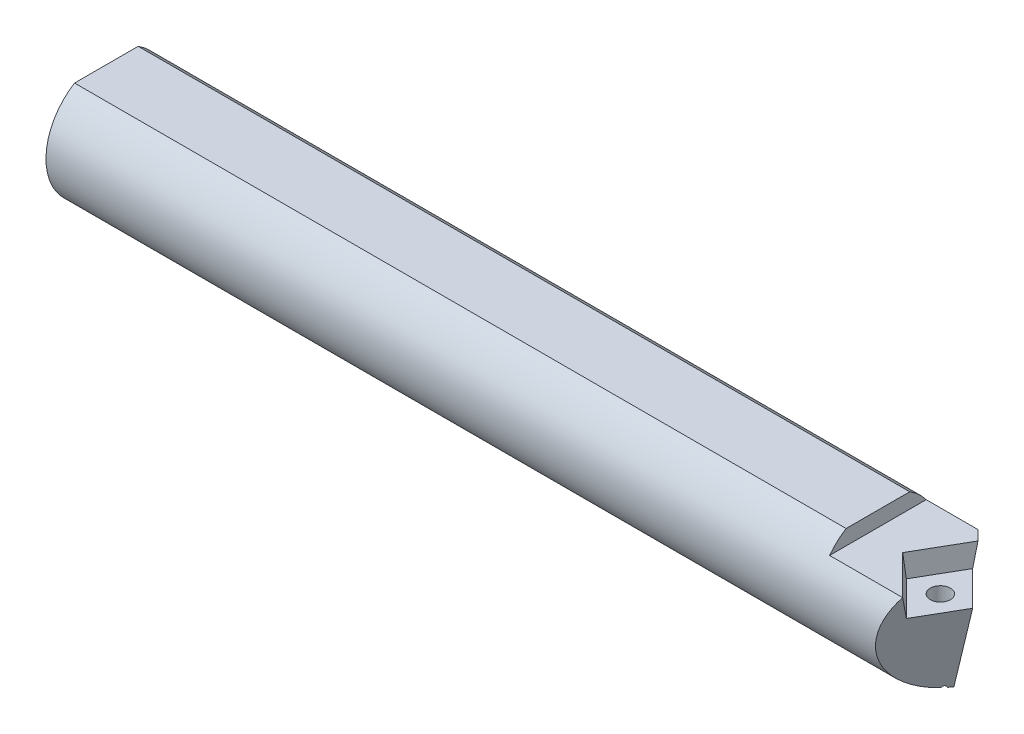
ISO-10303-21;
HEADER;
FILE_DESCRIPTION(('STEP AP214'),'2;1');
FILE_NAME('part.step','',(''),(''),'','','');
FILE_SCHEMA(('AUTOMOTIVE_DESIGN { 1 0 10303 214 1 1 1 1 }'));
ENDSEC;
DATA;
#1=APPLICATION_CONTEXT('core data for automotive mechanical design processes');
#2=APPLICATION_PROTOCOL_DEFINITION('international standard','automotive_design',2000,#1);
#3=PRODUCT_CONTEXT('',#1,'mechanical');
#4=PRODUCT('Part','Part','',(#3));
#5=PRODUCT_RELATED_PRODUCT_CATEGORY('part','',(#4));
#6=PRODUCT_DEFINITION_FORMATION('','',#4);
#7=PRODUCT_DEFINITION_CONTEXT('part definition',#1,'design');
#8=PRODUCT_DEFINITION('design','',#6,#7);
#9=PRODUCT_DEFINITION_SHAPE('','',#8);
#10=(LENGTH_UNIT() NAMED_UNIT(*) SI_UNIT(.MILLI.,.METRE.));
#11=(NAMED_UNIT(*) PLANE_ANGLE_UNIT() SI_UNIT($,.RADIAN.));
#12=(NAMED_UNIT(*) SI_UNIT($,.STERADIAN.) SOLID_ANGLE_UNIT());
#13=UNCERTAINTY_MEASURE_WITH_UNIT(LENGTH_MEASURE(1.E-05),#10,'distance_accuracy_value','');
#14=(GEOMETRIC_REPRESENTATION_CONTEXT(3) GLOBAL_UNCERTAINTY_ASSIGNED_CONTEXT((#13)) GLOBAL_UNIT_ASSIGNED_CONTEXT((#10,
#11,#12)) REPRESENTATION_CONTEXT('',''));
#15=CARTESIAN_POINT('',(0.,0.,0.));
#16=DIRECTION('',(0.,0.,1.));
#17=DIRECTION('',(1.,0.,0.));
#18=AXIS2_PLACEMENT_3D('',#15,#16,#17);
#19=CARTESIAN_POINT('',(50.,5.4,10.3667208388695));
#20=DIRECTION('',(0.,-1.,0.));
#21=DIRECTION('',(0.,0.,-1.));
#22=AXIS2_PLACEMENT_3D('',#19,#20,#21);
#23=PLANE('',#22);
#24=DIRECTION('',(-0.707106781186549,0.,-0.707106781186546));
#25=VECTOR('',#24,1.);
#26=CARTESIAN_POINT('',(32.4594046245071,5.4,-32.4594046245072));
#27=LINE('',#26,#25);
#28=CARTESIAN_POINT('',(59.1875165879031,5.4,-5.73129266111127));
#29=VERTEX_POINT('',#28);
#30=CARTESIAN_POINT('',(57.7188092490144,5.4,-7.2));
#31=VERTEX_POINT('',#30);
#32=EDGE_CURVE('E254',#29,#31,#27,.T.);
#33=ORIENTED_EDGE('',*,*,#32,.T.);
#34=DIRECTION('',(-1.,0.,0.));
#35=VECTOR('',#34,1.);
#36=CARTESIAN_POINT('',(65.,5.4,-7.2));
#37=LINE('',#36,#35);
#38=CARTESIAN_POINT('',(50.,5.4,-7.2));
#39=VERTEX_POINT('',#38);
#40=EDGE_CURVE('E154',#39,#31,#37,.F.);
#41=ORIENTED_EDGE('',*,*,#40,.F.);
#42=DIRECTION('',(0.,0.,-1.));
#43=VECTOR('',#42,1.);
#44=CARTESIAN_POINT('',(50.,5.4,10.3667208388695));
#45=LINE('',#44,#43);
#46=CARTESIAN_POINT('',(50.,5.4,7.2));
#47=VERTEX_POINT('',#46);
#48=EDGE_CURVE('E151',#47,#39,#45,.T.);
#49=ORIENTED_EDGE('',*,*,#48,.F.);
#50=DIRECTION('',(-1.,0.,0.));
#51=VECTOR('',#50,1.);
#52=CARTESIAN_POINT('',(65.,5.4,7.2));
#53=LINE('',#52,#51);
#54=CARTESIAN_POINT('',(60.889953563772,5.4,7.2));
#55=VERTEX_POINT('',#54);
#56=EDGE_CURVE('E130',#55,#47,#53,.T.);
#57=ORIENTED_EDGE('',*,*,#56,.F.);
#58=DIRECTION('',(0.707106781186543,0.,0.707106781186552));
#59=VECTOR('',#58,1.);
#60=CARTESIAN_POINT('',(60.889953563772,5.4,7.2));
#61=LINE('',#60,#59);
#62=CARTESIAN_POINT('',(55.0774701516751,5.4,1.38751658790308));
#63=VERTEX_POINT('',#62);
#64=EDGE_CURVE('E138',#63,#55,#61,.T.);
#65=ORIENTED_EDGE('',*,*,#64,.F.);
#66=DIRECTION('',(-0.500000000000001,0.,0.866025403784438));
#67=VECTOR('',#66,1.);
#68=CARTESIAN_POINT('',(55.0774701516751,5.4,1.38751658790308));
#69=LINE('',#68,#67);
#70=EDGE_CURVE('E147',#29,#63,#69,.T.);
#71=ORIENTED_EDGE('',*,*,#70,.F.);
#72=EDGE_LOOP('',(#33,#41,#49,#57,#65,#71));
#73=FACE_BOUND('',#72,.T.);
#74=ADVANCED_FACE('F39',(#73),#23,.F.);
#75=CARTESIAN_POINT('',(65.,0.,0.));
#76=DIRECTION('',(-1.,0.,0.));
#77=DIRECTION('',(0.,0.,1.));
#78=AXIS2_PLACEMENT_3D('',#75,#76,#77);
#79=CYLINDRICAL_SURFACE('',#78,9.);
#80=CARTESIAN_POINT('',(63.5722436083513,0.,0.));
#81=DIRECTION('',(-0.696364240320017,0.173648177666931,0.696364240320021));
#82=DIRECTION('',(-0.717688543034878,-0.168488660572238,-0.675673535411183));
#83=AXIS2_PLACEMENT_3D('',#80,#81,#82);
#84=ELLIPSE('',#83,12.9242707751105,9.);
#85=CARTESIAN_POINT('',(60.7424942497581,-8.98062018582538,-0.590305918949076));
#86=VERTEX_POINT('',#85);
#87=EDGE_CURVE('E258',#86,#31,#84,.F.);
#88=ORIENTED_EDGE('',*,*,#87,.F.);
#89=CARTESIAN_POINT('',(58.7307883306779,-9.,0.));
#90=CARTESIAN_POINT('',(58.6899566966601,-8.99999886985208,0.0727311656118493));
#91=CARTESIAN_POINT('',(58.6551839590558,-8.99911060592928,0.148914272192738));
#92=CARTESIAN_POINT('',(58.5987760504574,-8.99514012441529,0.305993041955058));
#93=CARTESIAN_POINT('',(58.5771514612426,-8.99205614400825,0.386892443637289));
#94=CARTESIAN_POINT('',(58.5476513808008,-8.98349231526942,0.551008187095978));
#95=CARTESIAN_POINT('',(58.539770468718,-8.97801341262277,0.634223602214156));
#96=CARTESIAN_POINT('',(58.5378909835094,-8.96470842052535,0.800605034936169));
#97=CARTESIAN_POINT('',(58.5438904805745,-8.95688265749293,0.883771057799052));
#98=CARTESIAN_POINT('',(58.5695317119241,-8.93915866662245,1.04799109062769));
#99=CARTESIAN_POINT('',(58.5892131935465,-8.92925445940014,1.12903823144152));
#100=CARTESIAN_POINT('',(58.6416196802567,-8.90791874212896,1.28658843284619));
#101=CARTESIAN_POINT('',(58.6743463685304,-8.89648703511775,1.36309090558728));
#102=CARTESIAN_POINT('',(58.7525726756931,-8.87260610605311,1.51081423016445));
#103=CARTESIAN_POINT('',(58.7982822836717,-8.86014276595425,1.58192162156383));
#104=CARTESIAN_POINT('',(58.9009792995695,-8.83525608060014,1.71548033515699));
#105=CARTESIAN_POINT('',(58.9579678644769,-8.82283273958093,1.77793076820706));
#106=CARTESIAN_POINT('',(59.0824394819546,-8.79883823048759,1.89313349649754));
#107=CARTESIAN_POINT('',(59.1500350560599,-8.78727842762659,1.94576676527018));
#108=CARTESIAN_POINT('',(59.2934143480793,-8.76614148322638,2.03888496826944));
#109=CARTESIAN_POINT('',(59.369197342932,-8.75656416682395,2.07937097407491));
#110=CARTESIAN_POINT('',(59.5257097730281,-8.74036800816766,2.14642652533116));
#111=CARTESIAN_POINT('',(59.606354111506,-8.73370924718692,2.17318475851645));
#112=CARTESIAN_POINT('',(59.7711950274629,-8.72377437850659,2.21273196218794));
#113=CARTESIAN_POINT('',(59.8553908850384,-8.72049758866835,2.22552374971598));
#114=CARTESIAN_POINT('',(60.0224324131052,-8.71768009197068,2.23653398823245));
#115=CARTESIAN_POINT('',(60.1052505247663,-8.71803802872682,2.23514779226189));
#116=CARTESIAN_POINT('',(60.2694416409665,-8.72221286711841,2.21879975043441));
#117=CARTESIAN_POINT('',(60.3508147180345,-8.72602959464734,2.20383858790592));
#118=CARTESIAN_POINT('',(60.509183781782,-8.73673288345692,2.16101269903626));
#119=CARTESIAN_POINT('',(60.5862089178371,-8.74359530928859,2.13324935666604));
#120=CARTESIAN_POINT('',(60.7345183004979,-8.75979537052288,2.06571655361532));
#121=CARTESIAN_POINT('',(60.8058018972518,-8.76913328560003,2.02594573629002));
#122=CARTESIAN_POINT('',(60.9422860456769,-8.7897512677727,1.93455599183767));
#123=CARTESIAN_POINT('',(61.007321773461,-8.80106895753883,1.88269951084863));
#124=CARTESIAN_POINT('',(61.1278741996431,-8.82461039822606,1.76907091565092));
#125=CARTESIAN_POINT('',(61.1833894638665,-8.83683428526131,1.70729731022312));
#126=CARTESIAN_POINT('',(61.2847373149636,-8.86159471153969,1.57380211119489));
#127=CARTESIAN_POINT('',(61.3302943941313,-8.87413145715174,1.50187111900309));
#128=CARTESIAN_POINT('',(61.4086535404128,-8.89831448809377,1.35122634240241));
#129=CARTESIAN_POINT('',(61.4414553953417,-8.90996075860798,1.27251244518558));
#130=CARTESIAN_POINT('',(61.4933466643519,-8.93162079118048,1.11033622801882));
#131=CARTESIAN_POINT('',(61.5124159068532,-8.94163213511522,1.02686711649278));
#132=CARTESIAN_POINT('',(61.5360950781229,-8.95944355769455,0.857672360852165));
#133=CARTESIAN_POINT('',(61.540706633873,-8.96724388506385,0.771946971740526));
#134=CARTESIAN_POINT('',(61.5352753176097,-8.98022225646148,0.60226598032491));
#135=CARTESIAN_POINT('',(61.5254861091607,-8.98544357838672,0.518305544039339));
#136=CARTESIAN_POINT('',(61.4919232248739,-8.99345057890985,0.353109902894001));
#137=CARTESIAN_POINT('',(61.4681504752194,-8.99623641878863,0.271874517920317));
#138=CARTESIAN_POINT('',(61.4076369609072,-8.99959621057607,0.115434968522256));
#139=CARTESIAN_POINT('',(61.3710506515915,-9.00019557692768,0.0401715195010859));
#140=CARTESIAN_POINT('',(61.285893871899,-8.99969396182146,-0.103231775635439));
#141=CARTESIAN_POINT('',(61.2373231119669,-8.99859293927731,-0.171371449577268));
#142=CARTESIAN_POINT('',(61.129349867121,-8.99526340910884,-0.298877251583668));
#143=CARTESIAN_POINT('',(61.0699054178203,-8.99303047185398,-0.358207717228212));
#144=CARTESIAN_POINT('',(60.9419748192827,-8.98808369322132,-0.466130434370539));
#145=CARTESIAN_POINT('',(60.8734882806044,-8.98536983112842,-0.514722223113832));
#146=CARTESIAN_POINT('',(60.728838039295,-8.98007171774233,-0.60013658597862));
#147=CARTESIAN_POINT('',(60.652621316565,-8.97748857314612,-0.636869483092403));
#148=CARTESIAN_POINT('',(60.4950860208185,-8.97301889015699,-0.697027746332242));
#149=CARTESIAN_POINT('',(60.4137674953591,-8.97113234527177,-0.720453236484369));
#150=CARTESIAN_POINT('',(60.2483626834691,-8.96843292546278,-0.753316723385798));
#151=CARTESIAN_POINT('',(60.1642773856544,-8.96761967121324,-0.762759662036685));
#152=CARTESIAN_POINT('',(59.9957150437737,-8.96722401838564,-0.767397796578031));
#153=CARTESIAN_POINT('',(59.9112380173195,-8.9676415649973,-0.76259362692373));
#154=CARTESIAN_POINT('',(59.7445628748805,-8.96962315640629,-0.738917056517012));
#155=CARTESIAN_POINT('',(59.6623585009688,-8.97118363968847,-0.720088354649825));
#156=CARTESIAN_POINT('',(59.5022592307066,-8.97514125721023,-0.66894825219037));
#157=CARTESIAN_POINT('',(59.4243652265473,-8.9775385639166,-0.636634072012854));
#158=CARTESIAN_POINT('',(59.2749021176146,-8.98268505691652,-0.559345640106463));
#159=CARTESIAN_POINT('',(59.2033495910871,-8.98543512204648,-0.514339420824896));
#160=CARTESIAN_POINT('',(59.0688430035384,-8.99066199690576,-0.412985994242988));
#161=CARTESIAN_POINT('',(59.0058814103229,-8.99313904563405,-0.356648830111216));
#162=CARTESIAN_POINT('',(58.9060246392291,-8.99661243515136,-0.250902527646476));
#163=CARTESIAN_POINT('',(58.8666954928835,-8.9978282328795,-0.203771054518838));
#164=CARTESIAN_POINT('',(58.7940826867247,-8.99952242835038,-0.105047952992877));
#165=CARTESIAN_POINT('',(58.7607989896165,-9.00000083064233,-0.0534563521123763));
#166=CARTESIAN_POINT('',(58.7307883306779,-9.,0.));
#167=B_SPLINE_CURVE_WITH_KNOTS('',3,(#89,#90,#91,#92,#93,#94,#95,#96,#97,#98,#99,#100,#101,#102,
#103,#104,#105,#106,#107,#108,#109,#110,#111,#112,#113,#114,#115,#116,#117,#118,#119,#120,#121,
#122,#123,#124,#125,#126,#127,#128,#129,#130,#131,#132,#133,#134,#135,#136,#137,#138,#139,#140,
#141,#142,#143,#144,#145,#146,#147,#148,#149,#150,#151,#152,#153,#154,#155,#156,#157,#158,#159,
#160,#161,#162,#163,#164,#165,#166),.UNSPECIFIED.,.T.,.F.,(4,2,2,2,2,2,2,2,2,2,2,2,2,2,2,2,2,2,
2,2,2,2,2,2,2,2,2,2,2,2,2,2,2,2,2,2,2,2,4),(0.,0.250005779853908,0.500212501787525,
0.750320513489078,1.00039375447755,1.25119653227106,1.50203168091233,1.75718068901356,
2.01235588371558,2.27044814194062,2.52851762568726,2.7829379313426,3.03730691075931,
3.28460259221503,3.53188582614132,3.7772435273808,4.02262896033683,4.27331932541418,
4.52404742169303,4.78101842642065,5.03799370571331,5.29534568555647,5.55266870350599,
5.80551300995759,6.05834057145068,6.30821985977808,6.55810518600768,6.80897605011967,
7.05985772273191,7.3125943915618,7.56532870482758,7.81797367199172,8.07060738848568,
8.32245720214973,8.57435895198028,8.82690092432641,9.07922003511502,9.26297179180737,
9.44672241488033),.UNSPECIFIED.);
#168=CARTESIAN_POINT('',(61.1354474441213,-8.82669347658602,1.75769231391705));
#169=VERTEX_POINT('',#168);
#170=EDGE_CURVE('E133',#86,#169,#167,.T.);
#171=ORIENTED_EDGE('',*,*,#170,.T.);
#172=CARTESIAN_POINT('',(63.9474092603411,0.,0.));
#173=DIRECTION('',(-0.852868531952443,0.173648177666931,-0.492403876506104));
#174=DIRECTION('',(-0.522125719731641,-0.283646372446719,0.804319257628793));
#175=AXIS2_PLACEMENT_3D('',#172,#173,#174);
#176=ELLIPSE('',#175,10.5526228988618,9.);
#177=EDGE_CURVE('E56',#55,#169,#176,.F.);
#178=ORIENTED_EDGE('',*,*,#177,.F.);
#179=ORIENTED_EDGE('',*,*,#56,.T.);
#180=CARTESIAN_POINT('',(50.,0.,0.));
#181=DIRECTION('',(-1.,0.,0.));
#182=DIRECTION('',(0.,0.,1.));
#183=AXIS2_PLACEMENT_3D('',#180,#181,#182);
#184=CIRCLE('',#183,9.);
#185=CARTESIAN_POINT('',(50.,7.65,4.74104418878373));
#186=VERTEX_POINT('',#185);
#187=EDGE_CURVE('E162',#47,#186,#184,.T.);
#188=ORIENTED_EDGE('',*,*,#187,.T.);
#189=DIRECTION('',(-1.,0.,0.));
#190=VECTOR('',#189,1.);
#191=CARTESIAN_POINT('',(65.,7.65,4.74104418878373));
#192=LINE('',#191,#190);
#193=CARTESIAN_POINT('',(-65.,7.65,4.74104418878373));
#194=VERTEX_POINT('',#193);
#195=EDGE_CURVE('E153',#194,#186,#192,.F.);
#196=ORIENTED_EDGE('',*,*,#195,.F.);
#197=CARTESIAN_POINT('',(-65.,0.,0.));
#198=DIRECTION('',(1.,0.,0.));
#199=DIRECTION('',(0.,0.,-1.));
#200=AXIS2_PLACEMENT_3D('',#197,#198,#199);
#201=CIRCLE('',#200,9.);
#202=CARTESIAN_POINT('',(-65.,7.65,-4.74104418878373));
#203=VERTEX_POINT('',#202);
#204=EDGE_CURVE('E168',#194,#203,#201,.T.);
#205=ORIENTED_EDGE('',*,*,#204,.T.);
#206=DIRECTION('',(-1.,0.,0.));
#207=VECTOR('',#206,1.);
#208=CARTESIAN_POINT('',(65.,7.65,-4.74104418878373));
#209=LINE('',#208,#207);
#210=CARTESIAN_POINT('',(50.,7.65,-4.74104418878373));
#211=VERTEX_POINT('',#210);
#212=EDGE_CURVE('E159',#211,#203,#209,.T.);
#213=ORIENTED_EDGE('',*,*,#212,.F.);
#214=EDGE_CURVE('E64',#211,#39,#184,.T.);
#215=ORIENTED_EDGE('',*,*,#214,.T.);
#216=ORIENTED_EDGE('',*,*,#40,.T.);
#217=EDGE_LOOP('',(#88,#171,#178,#179,#188,#196,#205,#213,#215,#216));
#218=FACE_BOUND('',#217,.T.);
#219=ADVANCED_FACE('F41',(#218),#79,.T.);
#220=CARTESIAN_POINT('',(61.8299491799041,-8.98618172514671,0.498535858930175));
#221=VERTEX_POINT('',#220);
#222=CARTESIAN_POINT('',(61.3687400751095,-8.99990774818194,0.0407495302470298));
#223=VERTEX_POINT('',#222);
#224=EDGE_CURVE('E187',#221,#223,#84,.F.);
#225=ORIENTED_EDGE('',*,*,#224,.F.);
#226=CARTESIAN_POINT('',(61.4933767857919,-8.93247093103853,1.10043767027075));
#227=VERTEX_POINT('',#226);
#228=EDGE_CURVE('E123',#227,#221,#176,.F.);
#229=ORIENTED_EDGE('',*,*,#228,.F.);
#230=EDGE_CURVE('E186',#227,#223,#167,.T.);
#231=ORIENTED_EDGE('',*,*,#230,.T.);
#232=EDGE_LOOP('',(#225,#229,#231));
#233=FACE_BOUND('',#232,.T.);
#234=ADVANCED_FACE('F185',(#233),#79,.T.);
#235=CARTESIAN_POINT('',(60.889953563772,5.4,7.2));
#236=DIRECTION('',(-0.701836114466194,-0.121869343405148,0.701836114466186));
#237=DIRECTION('',(0.707106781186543,0.,0.707106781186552));
#238=AXIS2_PLACEMENT_3D('',#235,#236,#237);
#239=PLANE('',#238);
#240=DIRECTION('',(-0.0635961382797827,-0.970602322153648,-0.232135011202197));
#241=VECTOR('',#240,1.);
#242=CARTESIAN_POINT('',(60.889953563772,5.4,7.2));
#243=LINE('',#242,#241);
#244=CARTESIAN_POINT('',(60.6815925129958,2.22,6.4394523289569));
#245=VERTEX_POINT('',#244);
#246=EDGE_CURVE('E113',#245,#55,#243,.F.);
#247=ORIENTED_EDGE('',*,*,#246,.F.);
#248=DIRECTION('',(0.707106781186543,0.,0.707106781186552));
#249=VECTOR('',#248,1.);
#250=CARTESIAN_POINT('',(61.1660468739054,2.22,6.92390668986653));
#251=LINE('',#250,#249);
#252=CARTESIAN_POINT('',(55.5654173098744,2.22,1.32327712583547));
#253=VERTEX_POINT('',#252);
#254=EDGE_CURVE('E244',#253,#245,#251,.T.);
#255=ORIENTED_EDGE('',*,*,#254,.F.);
#256=DIRECTION('',(-0.151637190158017,0.988234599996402,0.0199634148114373));
#257=VECTOR('',#256,1.);
#258=CARTESIAN_POINT('',(55.0774701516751,5.4,1.38751658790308));
#259=LINE('',#258,#257);
#260=EDGE_CURVE('E141',#253,#63,#259,.T.);
#261=ORIENTED_EDGE('',*,*,#260,.T.);
#262=ORIENTED_EDGE('',*,*,#64,.T.);
#263=EDGE_LOOP('',(#247,#255,#261,#262));
#264=FACE_BOUND('',#263,.T.);
#265=ADVANCED_FACE('F139',(#264),#239,.F.);
#266=CARTESIAN_POINT('',(55.0774701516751,5.4,1.38751658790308));
#267=DIRECTION('',(-0.859570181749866,-0.121869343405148,-0.496273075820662));
#268=DIRECTION('',(-0.500000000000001,0.,0.866025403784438));
#269=AXIS2_PLACEMENT_3D('',#266,#267,#268);
#270=PLANE('',#269);
#271=DIRECTION('',(0.00134819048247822,0.970602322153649,-0.240685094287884));
#272=VECTOR('',#271,1.);
#273=CARTESIAN_POINT('',(59.1851991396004,3.73160022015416,-5.31757125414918));
#274=LINE('',#273,#272);
#275=CARTESIAN_POINT('',(59.1830994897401,2.22,-4.94273221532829));
#276=VERTEX_POINT('',#275);
#277=EDGE_CURVE('E253',#29,#276,#274,.F.);
#278=ORIENTED_EDGE('',*,*,#277,.F.);
#279=ORIENTED_EDGE('',*,*,#70,.T.);
#280=ORIENTED_EDGE('',*,*,#260,.F.);
#281=DIRECTION('',(-0.500000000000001,0.,0.866025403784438));
#282=VECTOR('',#281,1.);
#283=CARTESIAN_POINT('',(55.4156140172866,2.22,1.5827440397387));
#284=LINE('',#283,#282);
#285=EDGE_CURVE('E146',#276,#253,#284,.T.);
#286=ORIENTED_EDGE('',*,*,#285,.F.);
#287=EDGE_LOOP('',(#278,#279,#280,#286));
#288=FACE_BOUND('',#287,.T.);
#289=ADVANCED_FACE('F213',(#288),#270,.F.);
#290=CARTESIAN_POINT('',(0.,2.22,0.));
#291=DIRECTION('',(0.,-1.,0.));
#292=DIRECTION('',(0.,0.,-1.));
#293=AXIS2_PLACEMENT_3D('',#290,#291,#292);
#294=PLANE('',#293);
#295=CARTESIAN_POINT('',(60.0387350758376,2.22,0.734353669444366));
#296=DIRECTION('',(0.,1.,0.));
#297=DIRECTION('',(0.,0.,1.));
#298=AXIS2_PLACEMENT_3D('',#295,#296,#297);
#299=CIRCLE('',#298,1.5);
#300=CARTESIAN_POINT('',(60.0387350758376,2.22,2.23435366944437));
#301=VERTEX_POINT('',#300);
#302=EDGE_CURVE('E196',#301,#301,#299,.T.);
#303=ORIENTED_EDGE('',*,*,#302,.F.);
#304=EDGE_LOOP('',(#303));
#305=FACE_BOUND('',#304,.T.);
#306=DIRECTION('',(-0.707106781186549,0.,-0.707106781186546));
#307=VECTOR('',#306,1.);
#308=CARTESIAN_POINT('',(32.062915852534,2.22,-32.0629158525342));
#309=LINE('',#308,#307);
#310=CARTESIAN_POINT('',(64.2992746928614,2.22,0.173442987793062));
#311=VERTEX_POINT('',#310);
#312=EDGE_CURVE('E251',#276,#311,#309,.F.);
#313=ORIENTED_EDGE('',*,*,#312,.F.);
#314=ORIENTED_EDGE('',*,*,#285,.T.);
#315=ORIENTED_EDGE('',*,*,#254,.T.);
#316=DIRECTION('',(0.5,0.,-0.866025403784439));
#317=VECTOR('',#316,1.);
#318=CARTESIAN_POINT('',(48.2995590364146,2.22,27.8857634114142));
#319=LINE('',#318,#317);
#320=EDGE_CURVE('E117',#311,#245,#319,.F.);
#321=ORIENTED_EDGE('',*,*,#320,.F.);
#322=EDGE_LOOP('',(#313,#314,#315,#321));
#323=FACE_BOUND('',#322,.T.);
#324=ADVANCED_FACE('F208',(#305,#323),#294,.F.);
#325=CARTESIAN_POINT('',(60.0387350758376,-9.,0.734353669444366));
#326=DIRECTION('',(0.,1.,0.));
#327=DIRECTION('',(0.,0.,1.));
#328=AXIS2_PLACEMENT_3D('',#325,#326,#327);
#329=CYLINDRICAL_SURFACE('',#328,1.5);
#330=ORIENTED_EDGE('',*,*,#302,.T.);
#331=EDGE_LOOP('',(#330));
#332=FACE_BOUND('',#331,.T.);
#333=CARTESIAN_POINT('',(60.0387350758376,-17.1149888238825,0.734353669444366));
#334=DIRECTION('',(-0.696364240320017,0.173648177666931,0.696364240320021));
#335=DIRECTION('',(0.122787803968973,0.984807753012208,-0.122787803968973));
#336=AXIS2_PLACEMENT_3D('',#333,#334,#335);
#337=ELLIPSE('',#336,8.63815572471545,1.5);
#338=EDGE_CURVE('E11',#223,#86,#337,.T.);
#339=ORIENTED_EDGE('',*,*,#338,.F.);
#340=ORIENTED_EDGE('',*,*,#230,.F.);
#341=CARTESIAN_POINT('',(60.0387350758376,-17.1149888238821,0.734353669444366));
#342=DIRECTION('',(-0.852868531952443,0.173648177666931,-0.492403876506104));
#343=DIRECTION('',(0.150383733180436,0.984807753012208,0.0868240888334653));
#344=AXIS2_PLACEMENT_3D('',#341,#342,#343);
#345=ELLIPSE('',#344,8.63815572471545,1.5);
#346=EDGE_CURVE('E49',#169,#227,#345,.T.);
#347=ORIENTED_EDGE('',*,*,#346,.F.);
#348=ORIENTED_EDGE('',*,*,#170,.F.);
#349=EDGE_LOOP('',(#339,#340,#347,#348));
#350=FACE_BOUND('',#349,.T.);
#351=ADVANCED_FACE('F190',(#332,#350),#329,.F.);
#352=CARTESIAN_POINT('',(-65.,0.,0.));
#353=DIRECTION('',(1.,0.,0.));
#354=DIRECTION('',(0.,0.,-1.));
#355=AXIS2_PLACEMENT_3D('',#352,#353,#354);
#356=PLANE('',#355);
#357=DIRECTION('',(0.,0.,1.));
#358=VECTOR('',#357,1.);
#359=CARTESIAN_POINT('',(-65.,7.65,0.));
#360=LINE('',#359,#358);
#361=EDGE_CURVE('E172',#203,#194,#360,.T.);
#362=ORIENTED_EDGE('',*,*,#361,.F.);
#363=ORIENTED_EDGE('',*,*,#204,.F.);
#364=EDGE_LOOP('',(#362,#363));
#365=FACE_BOUND('',#364,.T.);
#366=ADVANCED_FACE('F207',(#365),#356,.F.);
#367=CARTESIAN_POINT('',(0.,7.65,0.));
#368=DIRECTION('',(0.,1.,0.));
#369=DIRECTION('',(0.,0.,1.));
#370=AXIS2_PLACEMENT_3D('',#367,#368,#369);
#371=PLANE('',#370);
#372=DIRECTION('',(0.,0.,1.));
#373=VECTOR('',#372,1.);
#374=CARTESIAN_POINT('',(50.,7.65,0.));
#375=LINE('',#374,#373);
#376=EDGE_CURVE('E175',#211,#186,#375,.T.);
#377=ORIENTED_EDGE('',*,*,#376,.F.);
#378=ORIENTED_EDGE('',*,*,#212,.T.);
#379=ORIENTED_EDGE('',*,*,#361,.T.);
#380=ORIENTED_EDGE('',*,*,#195,.T.);
#381=EDGE_LOOP('',(#377,#378,#379,#380));
#382=FACE_BOUND('',#381,.T.);
#383=ADVANCED_FACE('F224',(#382),#371,.T.);
#384=CARTESIAN_POINT('',(50.,0.,0.));
#385=DIRECTION('',(-1.,0.,0.));
#386=DIRECTION('',(0.,0.,1.));
#387=AXIS2_PLACEMENT_3D('',#384,#385,#386);
#388=PLANE('',#387);
#389=ORIENTED_EDGE('',*,*,#48,.T.);
#390=ORIENTED_EDGE('',*,*,#214,.F.);
#391=ORIENTED_EDGE('',*,*,#376,.T.);
#392=ORIENTED_EDGE('',*,*,#187,.F.);
#393=EDGE_LOOP('',(#389,#390,#391,#392));
#394=FACE_BOUND('',#393,.T.);
#395=ADVANCED_FACE('F220',(#394),#388,.F.);
#396=CARTESIAN_POINT('',(32.4594046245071,5.4,-32.4594046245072));
#397=DIRECTION('',(-0.696364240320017,0.173648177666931,0.696364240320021));
#398=DIRECTION('',(0.707106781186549,0.,0.707106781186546));
#399=AXIS2_PLACEMENT_3D('',#396,#397,#398);
#400=PLANE('',#399);
#401=ORIENTED_EDGE('',*,*,#277,.T.);
#402=ORIENTED_EDGE('',*,*,#312,.T.);
#403=DIRECTION('',(0.215105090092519,0.976180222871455,-0.0283191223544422));
#404=VECTOR('',#403,1.);
#405=CARTESIAN_POINT('',(64.0786541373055,1.21878974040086,0.202488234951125));
#406=LINE('',#405,#404);
#407=EDGE_CURVE('E135',#221,#311,#406,.T.);
#408=ORIENTED_EDGE('',*,*,#407,.F.);
#409=ORIENTED_EDGE('',*,*,#224,.T.);
#410=ORIENTED_EDGE('',*,*,#338,.T.);
#411=ORIENTED_EDGE('',*,*,#87,.T.);
#412=ORIENTED_EDGE('',*,*,#32,.F.);
#413=EDGE_LOOP('',(#401,#402,#408,#409,#410,#411,#412));
#414=FACE_BOUND('',#413,.T.);
#415=ADVANCED_FACE('F223',(#414),#400,.F.);
#416=CARTESIAN_POINT('',(48.785156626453,5.4,28.1661233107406));
#417=DIRECTION('',(-0.852868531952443,0.173648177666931,-0.492403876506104));
#418=DIRECTION('',(-0.5,0.,0.866025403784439));
#419=AXIS2_PLACEMENT_3D('',#416,#417,#418);
#420=PLANE('',#419);
#421=ORIENTED_EDGE('',*,*,#320,.T.);
#422=ORIENTED_EDGE('',*,*,#246,.T.);
#423=ORIENTED_EDGE('',*,*,#177,.T.);
#424=ORIENTED_EDGE('',*,*,#346,.T.);
#425=ORIENTED_EDGE('',*,*,#228,.T.);
#426=ORIENTED_EDGE('',*,*,#407,.T.);
#427=EDGE_LOOP('',(#421,#422,#423,#424,#425,#426));
#428=FACE_BOUND('',#427,.T.);
#429=ADVANCED_FACE('F114',(#428),#420,.F.);
#430=CLOSED_SHELL('',(#74,#219,#234,#265,#289,#324,#351,#366,#383,#395,#415,#429));
#431=MANIFOLD_SOLID_BREP('B2',#430);
#432=ADVANCED_BREP_SHAPE_REPRESENTATION('',(#18,#431),#14);
#433=SHAPE_DEFINITION_REPRESENTATION(#9,#432);
ENDSEC;
END-ISO-10303-21;
